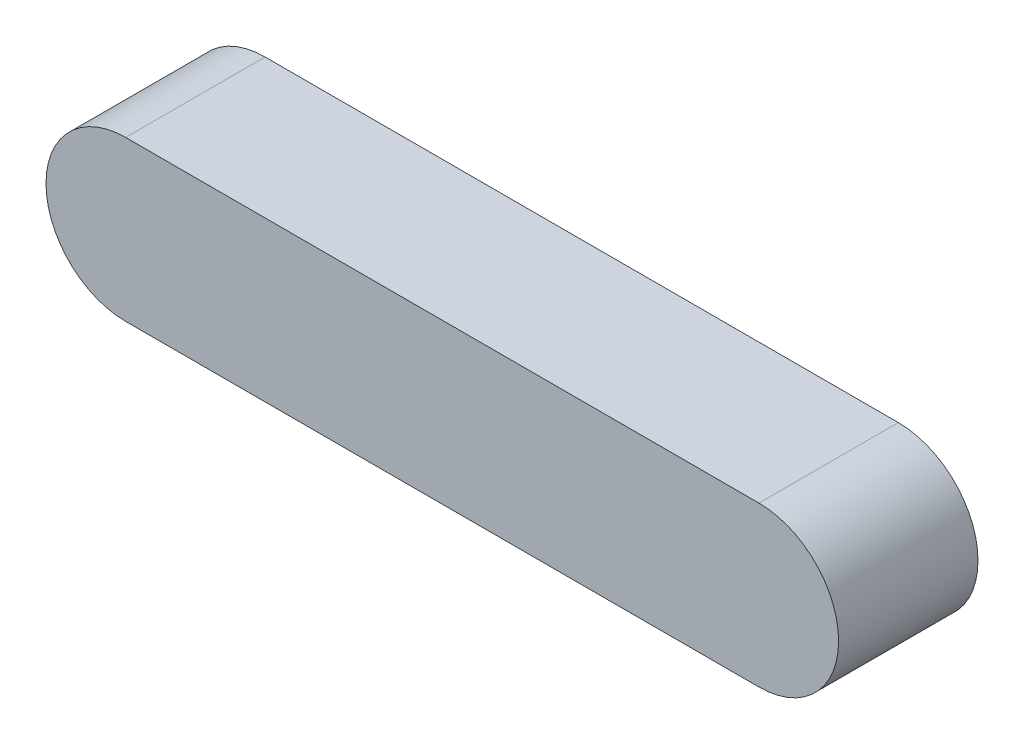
ISO-10303-21;
HEADER;
FILE_DESCRIPTION(('STEP AP214'),'2;1');
FILE_NAME('part.step','',(''),(''),'','','');
FILE_SCHEMA(('AUTOMOTIVE_DESIGN { 1 0 10303 214 1 1 1 1 }'));
ENDSEC;
DATA;
#1=APPLICATION_CONTEXT('core data for automotive mechanical design processes');
#2=APPLICATION_PROTOCOL_DEFINITION('international standard','automotive_design',2000,#1);
#3=PRODUCT_CONTEXT('',#1,'mechanical');
#4=PRODUCT('Part','Part','',(#3));
#5=PRODUCT_RELATED_PRODUCT_CATEGORY('part','',(#4));
#6=PRODUCT_DEFINITION_FORMATION('','',#4);
#7=PRODUCT_DEFINITION_CONTEXT('part definition',#1,'design');
#8=PRODUCT_DEFINITION('design','',#6,#7);
#9=PRODUCT_DEFINITION_SHAPE('','',#8);
#10=(LENGTH_UNIT() NAMED_UNIT(*) SI_UNIT(.MILLI.,.METRE.));
#11=(NAMED_UNIT(*) PLANE_ANGLE_UNIT() SI_UNIT($,.RADIAN.));
#12=(NAMED_UNIT(*) SI_UNIT($,.STERADIAN.) SOLID_ANGLE_UNIT());
#13=UNCERTAINTY_MEASURE_WITH_UNIT(LENGTH_MEASURE(1.E-05),#10,'distance_accuracy_value','');
#14=(GEOMETRIC_REPRESENTATION_CONTEXT(3) GLOBAL_UNCERTAINTY_ASSIGNED_CONTEXT((#13)) GLOBAL_UNIT_ASSIGNED_CONTEXT((#10,
#11,#12)) REPRESENTATION_CONTEXT('',''));
#15=CARTESIAN_POINT('',(0.,0.,0.));
#16=DIRECTION('',(0.,0.,1.));
#17=DIRECTION('',(1.,0.,0.));
#18=AXIS2_PLACEMENT_3D('',#15,#16,#17);
#19=CARTESIAN_POINT('',(15.9,0.,7.));
#20=DIRECTION('',(0.,0.,-1.));
#21=DIRECTION('',(-1.,0.,0.));
#22=AXIS2_PLACEMENT_3D('',#19,#20,#21);
#23=CYLINDRICAL_SURFACE('',#22,4.);
#24=CARTESIAN_POINT('',(15.9,0.,0.));
#25=DIRECTION('',(0.,0.,1.));
#26=DIRECTION('',(1.,0.,0.));
#27=AXIS2_PLACEMENT_3D('',#24,#25,#26);
#28=CIRCLE('',#27,4.);
#29=CARTESIAN_POINT('',(15.9,-4.,0.));
#30=VERTEX_POINT('',#29);
#31=CARTESIAN_POINT('',(15.9,4.,0.));
#32=VERTEX_POINT('',#31);
#33=EDGE_CURVE('E80',#30,#32,#28,.T.);
#34=ORIENTED_EDGE('',*,*,#33,.T.);
#35=DIRECTION('',(0.,0.,-1.));
#36=VECTOR('',#35,1.);
#37=CARTESIAN_POINT('',(15.9,4.,7.));
#38=LINE('',#37,#36);
#39=CARTESIAN_POINT('',(15.9,4.,7.));
#40=VERTEX_POINT('',#39);
#41=EDGE_CURVE('E11',#40,#32,#38,.T.);
#42=ORIENTED_EDGE('',*,*,#41,.F.);
#43=CARTESIAN_POINT('',(15.9,0.,7.));
#44=DIRECTION('',(0.,0.,1.));
#45=DIRECTION('',(1.,0.,0.));
#46=AXIS2_PLACEMENT_3D('',#43,#44,#45);
#47=CIRCLE('',#46,4.);
#48=CARTESIAN_POINT('',(15.9,-4.,7.));
#49=VERTEX_POINT('',#48);
#50=EDGE_CURVE('E98',#49,#40,#47,.T.);
#51=ORIENTED_EDGE('',*,*,#50,.F.);
#52=DIRECTION('',(0.,0.,-1.));
#53=VECTOR('',#52,1.);
#54=CARTESIAN_POINT('',(15.9,-4.,7.));
#55=LINE('',#54,#53);
#56=EDGE_CURVE('E92',#49,#30,#55,.T.);
#57=ORIENTED_EDGE('',*,*,#56,.T.);
#58=EDGE_LOOP('',(#34,#42,#51,#57));
#59=FACE_BOUND('',#58,.T.);
#60=ADVANCED_FACE('F36',(#59),#23,.T.);
#61=CARTESIAN_POINT('',(15.9,4.,7.));
#62=DIRECTION('',(0.,-1.,0.));
#63=DIRECTION('',(1.,0.,0.));
#64=AXIS2_PLACEMENT_3D('',#61,#62,#63);
#65=PLANE('',#64);
#66=DIRECTION('',(-1.,0.,0.));
#67=VECTOR('',#66,1.);
#68=CARTESIAN_POINT('',(15.9,4.,0.));
#69=LINE('',#68,#67);
#70=CARTESIAN_POINT('',(-15.9,4.,0.));
#71=VERTEX_POINT('',#70);
#72=EDGE_CURVE('E76',#32,#71,#69,.T.);
#73=ORIENTED_EDGE('',*,*,#72,.T.);
#74=DIRECTION('',(0.,0.,-1.));
#75=VECTOR('',#74,1.);
#76=CARTESIAN_POINT('',(-15.9,4.,7.));
#77=LINE('',#76,#75);
#78=CARTESIAN_POINT('',(-15.9,4.,7.));
#79=VERTEX_POINT('',#78);
#80=EDGE_CURVE('E43',#79,#71,#77,.T.);
#81=ORIENTED_EDGE('',*,*,#80,.F.);
#82=DIRECTION('',(-1.,0.,0.));
#83=VECTOR('',#82,1.);
#84=CARTESIAN_POINT('',(15.9,4.,7.));
#85=LINE('',#84,#83);
#86=EDGE_CURVE('E88',#40,#79,#85,.T.);
#87=ORIENTED_EDGE('',*,*,#86,.F.);
#88=ORIENTED_EDGE('',*,*,#41,.T.);
#89=EDGE_LOOP('',(#73,#81,#87,#88));
#90=FACE_BOUND('',#89,.T.);
#91=ADVANCED_FACE('F87',(#90),#65,.F.);
#92=CARTESIAN_POINT('',(-15.9,0.,7.));
#93=DIRECTION('',(0.,0.,-1.));
#94=DIRECTION('',(-1.,0.,0.));
#95=AXIS2_PLACEMENT_3D('',#92,#93,#94);
#96=CYLINDRICAL_SURFACE('',#95,4.);
#97=CARTESIAN_POINT('',(-15.9,0.,0.));
#98=DIRECTION('',(0.,0.,1.));
#99=DIRECTION('',(-1.,0.,0.));
#100=AXIS2_PLACEMENT_3D('',#97,#98,#99);
#101=CIRCLE('',#100,4.);
#102=CARTESIAN_POINT('',(-15.9,-4.,0.));
#103=VERTEX_POINT('',#102);
#104=EDGE_CURVE('E81',#71,#103,#101,.T.);
#105=ORIENTED_EDGE('',*,*,#104,.T.);
#106=DIRECTION('',(0.,0.,-1.));
#107=VECTOR('',#106,1.);
#108=CARTESIAN_POINT('',(-15.9,-4.,7.));
#109=LINE('',#108,#107);
#110=CARTESIAN_POINT('',(-15.9,-4.,7.));
#111=VERTEX_POINT('',#110);
#112=EDGE_CURVE('E104',#111,#103,#109,.T.);
#113=ORIENTED_EDGE('',*,*,#112,.F.);
#114=CARTESIAN_POINT('',(-15.9,0.,7.));
#115=DIRECTION('',(0.,0.,1.));
#116=DIRECTION('',(-1.,0.,0.));
#117=AXIS2_PLACEMENT_3D('',#114,#115,#116);
#118=CIRCLE('',#117,4.);
#119=EDGE_CURVE('E55',#79,#111,#118,.T.);
#120=ORIENTED_EDGE('',*,*,#119,.F.);
#121=ORIENTED_EDGE('',*,*,#80,.T.);
#122=EDGE_LOOP('',(#105,#113,#120,#121));
#123=FACE_BOUND('',#122,.T.);
#124=ADVANCED_FACE('F107',(#123),#96,.T.);
#125=CARTESIAN_POINT('',(15.9,-4.,7.));
#126=DIRECTION('',(0.,1.,0.));
#127=DIRECTION('',(-1.,0.,0.));
#128=AXIS2_PLACEMENT_3D('',#125,#126,#127);
#129=PLANE('',#128);
#130=DIRECTION('',(1.,0.,0.));
#131=VECTOR('',#130,1.);
#132=CARTESIAN_POINT('',(15.9,-4.,0.));
#133=LINE('',#132,#131);
#134=EDGE_CURVE('E96',#103,#30,#133,.T.);
#135=ORIENTED_EDGE('',*,*,#134,.T.);
#136=ORIENTED_EDGE('',*,*,#56,.F.);
#137=DIRECTION('',(1.,0.,0.));
#138=VECTOR('',#137,1.);
#139=CARTESIAN_POINT('',(15.9,-4.,7.));
#140=LINE('',#139,#138);
#141=EDGE_CURVE('E50',#111,#49,#140,.T.);
#142=ORIENTED_EDGE('',*,*,#141,.F.);
#143=ORIENTED_EDGE('',*,*,#112,.T.);
#144=EDGE_LOOP('',(#135,#136,#142,#143));
#145=FACE_BOUND('',#144,.T.);
#146=ADVANCED_FACE('F109',(#145),#129,.F.);
#147=CARTESIAN_POINT('',(15.9,0.,7.));
#148=DIRECTION('',(0.,0.,1.));
#149=DIRECTION('',(1.,0.,0.));
#150=AXIS2_PLACEMENT_3D('',#147,#148,#149);
#151=PLANE('',#150);
#152=ORIENTED_EDGE('',*,*,#50,.T.);
#153=ORIENTED_EDGE('',*,*,#86,.T.);
#154=ORIENTED_EDGE('',*,*,#119,.T.);
#155=ORIENTED_EDGE('',*,*,#141,.T.);
#156=EDGE_LOOP('',(#152,#153,#154,#155));
#157=FACE_BOUND('',#156,.T.);
#158=ADVANCED_FACE('F110',(#157),#151,.T.);
#159=CARTESIAN_POINT('',(15.9,0.,0.));
#160=DIRECTION('',(0.,0.,1.));
#161=DIRECTION('',(1.,0.,0.));
#162=AXIS2_PLACEMENT_3D('',#159,#160,#161);
#163=PLANE('',#162);
#164=ORIENTED_EDGE('',*,*,#33,.F.);
#165=ORIENTED_EDGE('',*,*,#134,.F.);
#166=ORIENTED_EDGE('',*,*,#104,.F.);
#167=ORIENTED_EDGE('',*,*,#72,.F.);
#168=EDGE_LOOP('',(#164,#165,#166,#167));
#169=FACE_BOUND('',#168,.T.);
#170=ADVANCED_FACE('F77',(#169),#163,.F.);
#171=CLOSED_SHELL('',(#60,#91,#124,#146,#158,#170));
#172=MANIFOLD_SOLID_BREP('B2',#171);
#173=ADVANCED_BREP_SHAPE_REPRESENTATION('',(#18,#172),#14);
#174=SHAPE_DEFINITION_REPRESENTATION(#9,#173);
ENDSEC;
END-ISO-10303-21;
